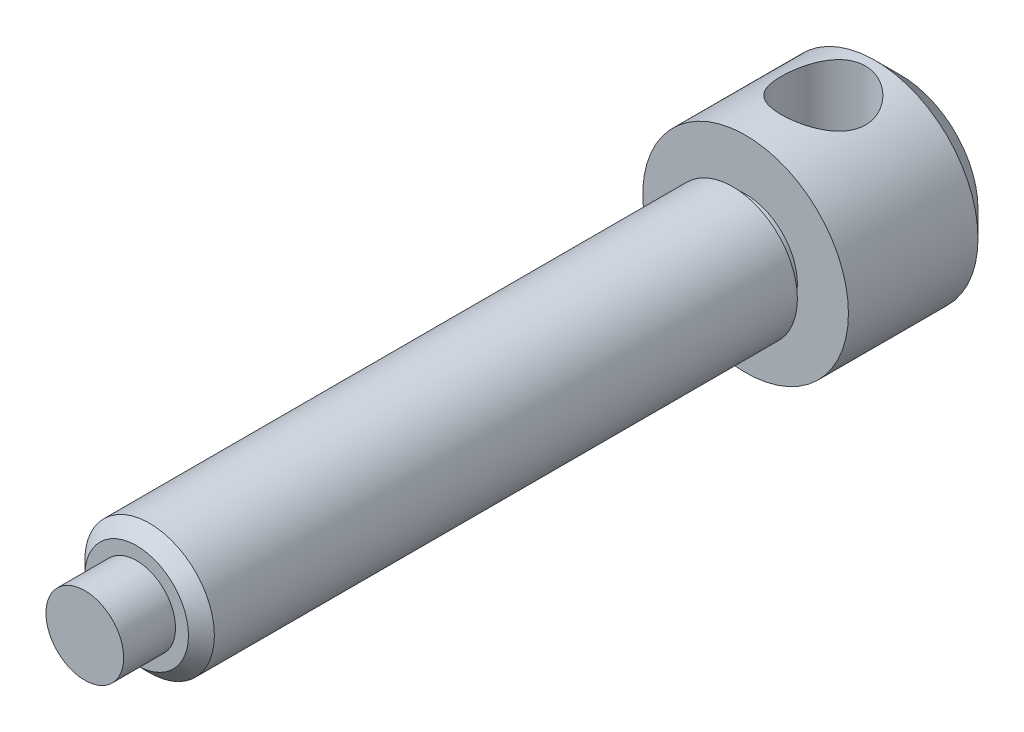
ISO-10303-21;
HEADER;
FILE_DESCRIPTION(('STEP AP214'),'2;1');
FILE_NAME('part.step','',(''),(''),'','','');
FILE_SCHEMA(('AUTOMOTIVE_DESIGN { 1 0 10303 214 1 1 1 1 }'));
ENDSEC;
DATA;
#1=APPLICATION_CONTEXT('core data for automotive mechanical design processes');
#2=APPLICATION_PROTOCOL_DEFINITION('international standard','automotive_design',2000,#1);
#3=PRODUCT_CONTEXT('',#1,'mechanical');
#4=PRODUCT('Part','Part','',(#3));
#5=PRODUCT_RELATED_PRODUCT_CATEGORY('part','',(#4));
#6=PRODUCT_DEFINITION_FORMATION('','',#4);
#7=PRODUCT_DEFINITION_CONTEXT('part definition',#1,'design');
#8=PRODUCT_DEFINITION('design','',#6,#7);
#9=PRODUCT_DEFINITION_SHAPE('','',#8);
#10=(LENGTH_UNIT() NAMED_UNIT(*) SI_UNIT(.MILLI.,.METRE.));
#11=(NAMED_UNIT(*) PLANE_ANGLE_UNIT() SI_UNIT($,.RADIAN.));
#12=(NAMED_UNIT(*) SI_UNIT($,.STERADIAN.) SOLID_ANGLE_UNIT());
#13=UNCERTAINTY_MEASURE_WITH_UNIT(LENGTH_MEASURE(1.E-05),#10,'distance_accuracy_value','');
#14=(GEOMETRIC_REPRESENTATION_CONTEXT(3) GLOBAL_UNCERTAINTY_ASSIGNED_CONTEXT((#13)) GLOBAL_UNIT_ASSIGNED_CONTEXT((#10,
#11,#12)) REPRESENTATION_CONTEXT('',''));
#15=CARTESIAN_POINT('',(0.,0.,0.));
#16=DIRECTION('',(0.,0.,1.));
#17=DIRECTION('',(1.,0.,0.));
#18=AXIS2_PLACEMENT_3D('',#15,#16,#17);
#19=CARTESIAN_POINT('',(0.,0.,12.));
#20=DIRECTION('',(0.,0.,-1.));
#21=DIRECTION('',(-1.,0.,0.));
#22=AXIS2_PLACEMENT_3D('',#19,#20,#21);
#23=CYLINDRICAL_SURFACE('',#22,7.9375);
#24=CARTESIAN_POINT('',(0.,0.,2.));
#25=DIRECTION('',(0.,0.,1.));
#26=DIRECTION('',(1.,0.,0.));
#27=AXIS2_PLACEMENT_3D('',#24,#25,#26);
#28=CIRCLE('',#27,7.9375);
#29=CARTESIAN_POINT('',(7.9375,0.,2.));
#30=VERTEX_POINT('',#29);
#31=EDGE_CURVE('E64',#30,#30,#28,.T.);
#32=ORIENTED_EDGE('',*,*,#31,.T.);
#33=EDGE_LOOP('',(#32));
#34=FACE_BOUND('',#33,.T.);
#35=CARTESIAN_POINT('',(0.,-7.9375,9.25));
#36=CARTESIAN_POINT('',(0.0872114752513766,-7.93749935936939,9.24999911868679));
#37=CARTESIAN_POINT('',(0.174458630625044,-7.93605721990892,9.24648240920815));
#38=CARTESIAN_POINT('',(0.348311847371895,-7.93033291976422,9.23246125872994));
#39=CARTESIAN_POINT('',(0.434917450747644,-7.92604889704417,9.2219522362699));
#40=CARTESIAN_POINT('',(0.693150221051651,-7.90905186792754,9.18000207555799));
#41=CARTESIAN_POINT('',(0.862947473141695,-7.89219432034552,9.13813816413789));
#42=CARTESIAN_POINT('',(1.19191578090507,-7.84925293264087,9.02850896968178));
#43=CARTESIAN_POINT('',(1.35112025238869,-7.82319991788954,8.96083016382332));
#44=CARTESIAN_POINT('',(1.65580455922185,-7.76442428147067,8.80184310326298));
#45=CARTESIAN_POINT('',(1.80128879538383,-7.73170380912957,8.71054246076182));
#46=CARTESIAN_POINT('',(2.08168417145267,-7.6610928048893,8.50219001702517));
#47=CARTESIAN_POINT('',(2.21583434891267,-7.62303677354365,8.38417131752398));
#48=CARTESIAN_POINT('',(2.46309024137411,-7.54677831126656,8.12777556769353));
#49=CARTESIAN_POINT('',(2.57618522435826,-7.50857581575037,7.98938819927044));
#50=CARTESIAN_POINT('',(2.78337576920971,-7.43434086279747,7.6882707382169));
#51=CARTESIAN_POINT('',(2.87632468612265,-7.39849553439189,7.5247007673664));
#52=CARTESIAN_POINT('',(3.03305054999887,-7.33564540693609,7.18256433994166));
#53=CARTESIAN_POINT('',(3.09684201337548,-7.30863621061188,7.00400539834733));
#54=CARTESIAN_POINT('',(3.19032953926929,-7.26830112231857,6.64570792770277));
#55=CARTESIAN_POINT('',(3.22148606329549,-7.25439221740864,6.46641856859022));
#56=CARTESIAN_POINT('',(3.25337848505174,-7.24014999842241,6.10465858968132));
#57=CARTESIAN_POINT('',(3.25413034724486,-7.23980956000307,5.92218968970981));
#58=CARTESIAN_POINT('',(3.22629503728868,-7.25224759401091,5.57356884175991));
#59=CARTESIAN_POINT('',(3.19986145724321,-7.26406311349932,5.40720378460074));
#60=CARTESIAN_POINT('',(3.12200857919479,-7.29785929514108,5.08151885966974));
#61=CARTESIAN_POINT('',(3.07058468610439,-7.31984182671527,4.92220029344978));
#62=CARTESIAN_POINT('',(2.94321760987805,-7.37198609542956,4.61118367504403));
#63=CARTESIAN_POINT('',(2.86678407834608,-7.40230929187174,4.45971471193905));
#64=CARTESIAN_POINT('',(2.69191295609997,-7.46767767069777,4.17117749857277));
#65=CARTESIAN_POINT('',(2.59346686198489,-7.502724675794,4.03411484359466));
#66=CARTESIAN_POINT('',(2.36795931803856,-7.57706169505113,3.76654761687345));
#67=CARTESIAN_POINT('',(2.23922161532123,-7.61646495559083,3.63748335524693));
#68=CARTESIAN_POINT('',(1.96152550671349,-7.69266136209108,3.40230257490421));
#69=CARTESIAN_POINT('',(1.81256269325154,-7.72945393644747,3.29619107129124));
#70=CARTESIAN_POINT('',(1.49439584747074,-7.79728624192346,3.10791402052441));
#71=CARTESIAN_POINT('',(1.32482419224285,-7.82818459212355,3.02631503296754));
#72=CARTESIAN_POINT('',(0.972773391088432,-7.87966918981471,2.89330295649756));
#73=CARTESIAN_POINT('',(0.790301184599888,-7.90026093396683,2.84187377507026));
#74=CARTESIAN_POINT('',(0.429681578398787,-7.9277963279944,2.77363121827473));
#75=CARTESIAN_POINT('',(0.251958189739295,-7.93550134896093,2.75488375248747));
#76=CARTESIAN_POINT('',(-0.104246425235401,-7.93881143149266,2.7467948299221));
#77=CARTESIAN_POINT('',(-0.282727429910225,-7.93441981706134,2.75744529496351));
#78=CARTESIAN_POINT('',(-0.626451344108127,-7.91452603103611,2.80644851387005));
#79=CARTESIAN_POINT('',(-0.791920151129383,-7.89956218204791,2.84345972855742));
#80=CARTESIAN_POINT('',(-1.11413118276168,-7.860596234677,2.94228502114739));
#81=CARTESIAN_POINT('',(-1.27087229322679,-7.83659298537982,3.00410225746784));
#82=CARTESIAN_POINT('',(-1.57663618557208,-7.78094023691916,3.1528058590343));
#83=CARTESIAN_POINT('',(-1.72527095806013,-7.74907743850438,3.24040765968));
#84=CARTESIAN_POINT('',(-2.00625906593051,-7.68113023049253,3.4374044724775));
#85=CARTESIAN_POINT('',(-2.13860567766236,-7.64504408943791,3.54680843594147));
#86=CARTESIAN_POINT('',(-2.39286503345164,-7.56947127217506,3.79315808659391));
#87=CARTESIAN_POINT('',(-2.51342484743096,-7.5299219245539,3.9314845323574));
#88=CARTESIAN_POINT('',(-2.72997831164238,-7.45414789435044,4.22706739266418));
#89=CARTESIAN_POINT('',(-2.82596707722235,-7.41792387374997,4.38432756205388));
#90=CARTESIAN_POINT('',(-2.99149511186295,-7.35274844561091,4.71616590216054));
#91=CARTESIAN_POINT('',(-3.06069792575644,-7.32389100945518,4.89093170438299));
#92=CARTESIAN_POINT('',(-3.16812703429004,-7.2780733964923,5.25118247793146));
#93=CARTESIAN_POINT('',(-3.20637769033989,-7.26110386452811,5.43665889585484));
#94=CARTESIAN_POINT('',(-3.24843599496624,-7.24237881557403,5.79811049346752));
#95=CARTESIAN_POINT('',(-3.25460676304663,-7.23957988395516,5.9737581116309));
#96=CARTESIAN_POINT('',(-3.23859385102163,-7.24675749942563,6.32347208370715));
#97=CARTESIAN_POINT('',(-3.21641417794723,-7.25673224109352,6.49753865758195));
#98=CARTESIAN_POINT('',(-3.14629169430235,-7.28739392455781,6.83138137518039));
#99=CARTESIAN_POINT('',(-3.09950922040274,-7.30759698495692,6.9914498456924));
#100=CARTESIAN_POINT('',(-2.98262133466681,-7.35607625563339,7.30151502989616));
#101=CARTESIAN_POINT('',(-2.91250941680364,-7.38435471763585,7.45150891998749));
#102=CARTESIAN_POINT('',(-2.74619029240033,-7.44786581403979,7.74680507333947));
#103=CARTESIAN_POINT('',(-2.64868889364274,-7.48341002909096,7.89131012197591));
#104=CARTESIAN_POINT('',(-2.43219717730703,-7.55654415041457,8.16265050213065));
#105=CARTESIAN_POINT('',(-2.31319982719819,-7.59413472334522,8.28948002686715));
#106=CARTESIAN_POINT('',(-2.04732477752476,-7.67025307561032,8.53089036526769));
#107=CARTESIAN_POINT('',(-1.89908649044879,-7.70866528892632,8.64401334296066));
#108=CARTESIAN_POINT('',(-1.58418806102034,-7.77947285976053,8.84386405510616));
#109=CARTESIAN_POINT('',(-1.41751951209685,-7.81186545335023,8.93057967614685));
#110=CARTESIAN_POINT('',(-1.15884715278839,-7.85292920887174,9.03778365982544));
#111=CARTESIAN_POINT('',(-1.07193923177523,-7.86529009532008,9.06953395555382));
#112=CARTESIAN_POINT('',(-0.895435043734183,-7.88733074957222,9.12558012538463));
#113=CARTESIAN_POINT('',(-0.805840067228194,-7.89701178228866,9.14987951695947));
#114=CARTESIAN_POINT('',(-0.624876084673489,-7.91338594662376,9.19070809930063));
#115=CARTESIAN_POINT('',(-0.53351209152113,-7.92008651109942,9.20725662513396));
#116=CARTESIAN_POINT('',(-0.349572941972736,-7.93033259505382,9.23247635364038));
#117=CARTESIAN_POINT('',(-0.256998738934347,-7.93388046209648,9.24115341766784));
#118=CARTESIAN_POINT('',(-0.136881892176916,-7.9363669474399,9.24723181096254));
#119=CARTESIAN_POINT('',(-0.109518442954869,-7.93679161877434,9.24826959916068));
#120=CARTESIAN_POINT('',(-0.0547711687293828,-7.93735824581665,9.24965383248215));
#121=CARTESIAN_POINT('',(-0.027387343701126,-7.93750020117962,9.25000027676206));
#122=CARTESIAN_POINT('',(0.,-7.9375,9.25));
#123=B_SPLINE_CURVE_WITH_KNOTS('',3,(#35,#36,#37,#38,#39,#40,#41,#42,#43,#44,#45,#46,#47,#48,
#49,#50,#51,#52,#53,#54,#55,#56,#57,#58,#59,#60,#61,#62,#63,#64,#65,#66,#67,#68,#69,#70,#71,#72,
#73,#74,#75,#76,#77,#78,#79,#80,#81,#82,#83,#84,#85,#86,#87,#88,#89,#90,#91,#92,#93,#94,#95,#96,
#97,#98,#99,#100,#101,#102,#103,#104,#105,#106,#107,#108,#109,#110,#111,#112,#113,#114,#115,
#116,#117,#118,#119,#120,#121,#122),.UNSPECIFIED.,.T.,.F.,(4,2,2,2,2,2,2,2,2,2,2,2,2,2,2,2,2,2,
2,2,2,2,2,2,2,2,2,2,2,2,2,2,2,2,2,2,2,2,2,2,2,2,2,4),(0.,0.2616040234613,0.523379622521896,
1.04765867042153,1.57019664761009,2.09256644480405,2.63823417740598,3.18417928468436,
3.75585462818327,4.32724504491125,4.87180262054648,5.41607426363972,5.92031894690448,
6.42465638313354,6.93954253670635,7.45462793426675,8.01161113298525,8.56871590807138,
9.13785062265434,9.70668148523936,10.2405345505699,10.7742409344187,11.2825655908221,
11.7909549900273,12.3150493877,12.8393594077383,13.3998996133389,13.960551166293,
14.5280326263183,15.0950670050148,15.6196714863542,16.1442018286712,16.6459592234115,
17.1478566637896,17.67932747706,18.2109724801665,18.7794587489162,19.348205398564,
19.6279421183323,19.9075465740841,20.1864497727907,20.4651451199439,20.5472975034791,
20.6294499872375),.UNSPECIFIED.);
#124=CARTESIAN_POINT('',(0.,-7.9375,9.25));
#125=VERTEX_POINT('',#124);
#126=EDGE_CURVE('E70',#125,#125,#123,.T.);
#127=ORIENTED_EDGE('',*,*,#126,.T.);
#128=EDGE_LOOP('',(#127));
#129=FACE_BOUND('',#128,.T.);
#130=CARTESIAN_POINT('',(0.,7.9375,9.25));
#131=CARTESIAN_POINT('',(-0.0872114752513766,7.93749935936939,9.24999911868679));
#132=CARTESIAN_POINT('',(-0.174458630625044,7.93605721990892,9.24648240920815));
#133=CARTESIAN_POINT('',(-0.348311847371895,7.93033291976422,9.23246125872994));
#134=CARTESIAN_POINT('',(-0.434917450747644,7.92604889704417,9.2219522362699));
#135=CARTESIAN_POINT('',(-0.693150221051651,7.90905186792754,9.18000207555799));
#136=CARTESIAN_POINT('',(-0.862947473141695,7.89219432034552,9.13813816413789));
#137=CARTESIAN_POINT('',(-1.19191578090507,7.84925293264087,9.02850896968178));
#138=CARTESIAN_POINT('',(-1.35112025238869,7.82319991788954,8.96083016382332));
#139=CARTESIAN_POINT('',(-1.65580455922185,7.76442428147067,8.80184310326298));
#140=CARTESIAN_POINT('',(-1.80128879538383,7.73170380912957,8.71054246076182));
#141=CARTESIAN_POINT('',(-2.08168417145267,7.6610928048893,8.50219001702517));
#142=CARTESIAN_POINT('',(-2.21583434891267,7.62303677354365,8.38417131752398));
#143=CARTESIAN_POINT('',(-2.46309024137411,7.54677831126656,8.12777556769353));
#144=CARTESIAN_POINT('',(-2.57618522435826,7.50857581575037,7.98938819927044));
#145=CARTESIAN_POINT('',(-2.78337576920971,7.43434086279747,7.6882707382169));
#146=CARTESIAN_POINT('',(-2.87632468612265,7.39849553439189,7.5247007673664));
#147=CARTESIAN_POINT('',(-3.03305054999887,7.33564540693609,7.18256433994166));
#148=CARTESIAN_POINT('',(-3.09684201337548,7.30863621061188,7.00400539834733));
#149=CARTESIAN_POINT('',(-3.19032953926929,7.26830112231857,6.64570792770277));
#150=CARTESIAN_POINT('',(-3.22148606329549,7.25439221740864,6.46641856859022));
#151=CARTESIAN_POINT('',(-3.25337848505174,7.24014999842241,6.10465858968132));
#152=CARTESIAN_POINT('',(-3.25413034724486,7.23980956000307,5.92218968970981));
#153=CARTESIAN_POINT('',(-3.22629503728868,7.25224759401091,5.57356884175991));
#154=CARTESIAN_POINT('',(-3.19986145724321,7.26406311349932,5.40720378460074));
#155=CARTESIAN_POINT('',(-3.12200857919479,7.29785929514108,5.08151885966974));
#156=CARTESIAN_POINT('',(-3.07058468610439,7.31984182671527,4.92220029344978));
#157=CARTESIAN_POINT('',(-2.94321760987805,7.37198609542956,4.61118367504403));
#158=CARTESIAN_POINT('',(-2.86678407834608,7.40230929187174,4.45971471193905));
#159=CARTESIAN_POINT('',(-2.69191295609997,7.46767767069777,4.17117749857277));
#160=CARTESIAN_POINT('',(-2.59346686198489,7.502724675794,4.03411484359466));
#161=CARTESIAN_POINT('',(-2.36795931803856,7.57706169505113,3.76654761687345));
#162=CARTESIAN_POINT('',(-2.23922161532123,7.61646495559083,3.63748335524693));
#163=CARTESIAN_POINT('',(-1.96152550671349,7.69266136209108,3.40230257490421));
#164=CARTESIAN_POINT('',(-1.81256269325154,7.72945393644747,3.29619107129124));
#165=CARTESIAN_POINT('',(-1.49439584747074,7.79728624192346,3.10791402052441));
#166=CARTESIAN_POINT('',(-1.32482419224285,7.82818459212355,3.02631503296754));
#167=CARTESIAN_POINT('',(-0.972773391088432,7.87966918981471,2.89330295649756));
#168=CARTESIAN_POINT('',(-0.790301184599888,7.90026093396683,2.84187377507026));
#169=CARTESIAN_POINT('',(-0.429681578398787,7.9277963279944,2.77363121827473));
#170=CARTESIAN_POINT('',(-0.251958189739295,7.93550134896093,2.75488375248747));
#171=CARTESIAN_POINT('',(0.104246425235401,7.93881143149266,2.7467948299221));
#172=CARTESIAN_POINT('',(0.282727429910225,7.93441981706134,2.75744529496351));
#173=CARTESIAN_POINT('',(0.626451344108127,7.91452603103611,2.80644851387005));
#174=CARTESIAN_POINT('',(0.791920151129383,7.89956218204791,2.84345972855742));
#175=CARTESIAN_POINT('',(1.11413118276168,7.860596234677,2.94228502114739));
#176=CARTESIAN_POINT('',(1.27087229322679,7.83659298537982,3.00410225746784));
#177=CARTESIAN_POINT('',(1.57663618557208,7.78094023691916,3.1528058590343));
#178=CARTESIAN_POINT('',(1.72527095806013,7.74907743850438,3.24040765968));
#179=CARTESIAN_POINT('',(2.00625906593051,7.68113023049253,3.4374044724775));
#180=CARTESIAN_POINT('',(2.13860567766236,7.64504408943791,3.54680843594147));
#181=CARTESIAN_POINT('',(2.39286503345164,7.56947127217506,3.79315808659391));
#182=CARTESIAN_POINT('',(2.51342484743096,7.5299219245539,3.9314845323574));
#183=CARTESIAN_POINT('',(2.72997831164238,7.45414789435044,4.22706739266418));
#184=CARTESIAN_POINT('',(2.82596707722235,7.41792387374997,4.38432756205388));
#185=CARTESIAN_POINT('',(2.99149511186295,7.35274844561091,4.71616590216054));
#186=CARTESIAN_POINT('',(3.06069792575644,7.32389100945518,4.89093170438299));
#187=CARTESIAN_POINT('',(3.16812703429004,7.2780733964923,5.25118247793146));
#188=CARTESIAN_POINT('',(3.20637769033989,7.26110386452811,5.43665889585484));
#189=CARTESIAN_POINT('',(3.24843599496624,7.24237881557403,5.79811049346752));
#190=CARTESIAN_POINT('',(3.25460676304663,7.23957988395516,5.9737581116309));
#191=CARTESIAN_POINT('',(3.23859385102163,7.24675749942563,6.32347208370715));
#192=CARTESIAN_POINT('',(3.21641417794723,7.25673224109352,6.49753865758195));
#193=CARTESIAN_POINT('',(3.14629169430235,7.28739392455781,6.83138137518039));
#194=CARTESIAN_POINT('',(3.09950922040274,7.30759698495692,6.9914498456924));
#195=CARTESIAN_POINT('',(2.98262133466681,7.35607625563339,7.30151502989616));
#196=CARTESIAN_POINT('',(2.91250941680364,7.38435471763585,7.45150891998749));
#197=CARTESIAN_POINT('',(2.74619029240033,7.44786581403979,7.74680507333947));
#198=CARTESIAN_POINT('',(2.64868889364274,7.48341002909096,7.89131012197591));
#199=CARTESIAN_POINT('',(2.43219717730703,7.55654415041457,8.16265050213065));
#200=CARTESIAN_POINT('',(2.31319982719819,7.59413472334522,8.28948002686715));
#201=CARTESIAN_POINT('',(2.04732477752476,7.67025307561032,8.53089036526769));
#202=CARTESIAN_POINT('',(1.89908649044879,7.70866528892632,8.64401334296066));
#203=CARTESIAN_POINT('',(1.58418806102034,7.77947285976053,8.84386405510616));
#204=CARTESIAN_POINT('',(1.41751951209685,7.81186545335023,8.93057967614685));
#205=CARTESIAN_POINT('',(1.15884715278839,7.85292920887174,9.03778365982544));
#206=CARTESIAN_POINT('',(1.07193923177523,7.86529009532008,9.06953395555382));
#207=CARTESIAN_POINT('',(0.895435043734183,7.88733074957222,9.12558012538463));
#208=CARTESIAN_POINT('',(0.805840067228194,7.89701178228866,9.14987951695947));
#209=CARTESIAN_POINT('',(0.624876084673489,7.91338594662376,9.19070809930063));
#210=CARTESIAN_POINT('',(0.53351209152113,7.92008651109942,9.20725662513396));
#211=CARTESIAN_POINT('',(0.349572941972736,7.93033259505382,9.23247635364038));
#212=CARTESIAN_POINT('',(0.256998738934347,7.93388046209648,9.24115341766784));
#213=CARTESIAN_POINT('',(0.136881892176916,7.9363669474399,9.24723181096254));
#214=CARTESIAN_POINT('',(0.109518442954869,7.93679161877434,9.24826959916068));
#215=CARTESIAN_POINT('',(0.0547711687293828,7.93735824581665,9.24965383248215));
#216=CARTESIAN_POINT('',(0.027387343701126,7.93750020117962,9.25000027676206));
#217=CARTESIAN_POINT('',(0.,7.9375,9.25));
#218=B_SPLINE_CURVE_WITH_KNOTS('',3,(#130,#131,#132,#133,#134,#135,#136,#137,#138,#139,#140,
#141,#142,#143,#144,#145,#146,#147,#148,#149,#150,#151,#152,#153,#154,#155,#156,#157,#158,#159,
#160,#161,#162,#163,#164,#165,#166,#167,#168,#169,#170,#171,#172,#173,#174,#175,#176,#177,#178,
#179,#180,#181,#182,#183,#184,#185,#186,#187,#188,#189,#190,#191,#192,#193,#194,#195,#196,#197,
#198,#199,#200,#201,#202,#203,#204,#205,#206,#207,#208,#209,#210,#211,#212,#213,#214,#215,#216,
#217),.UNSPECIFIED.,.T.,.F.,(4,2,2,2,2,2,2,2,2,2,2,2,2,2,2,2,2,2,2,2,2,2,2,2,2,2,2,2,2,2,2,2,2,
2,2,2,2,2,2,2,2,2,2,4),(0.,0.2616040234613,0.523379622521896,1.04765867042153,1.57019664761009,
2.09256644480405,2.63823417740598,3.18417928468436,3.75585462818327,4.32724504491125,
4.87180262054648,5.41607426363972,5.92031894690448,6.42465638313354,6.93954253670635,
7.45462793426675,8.01161113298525,8.56871590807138,9.13785062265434,9.70668148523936,
10.2405345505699,10.7742409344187,11.2825655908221,11.7909549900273,12.3150493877,
12.8393594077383,13.3998996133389,13.960551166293,14.5280326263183,15.0950670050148,
15.6196714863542,16.1442018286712,16.6459592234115,17.1478566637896,17.67932747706,
18.2109724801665,18.7794587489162,19.348205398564,19.6279421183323,19.9075465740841,
20.1864497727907,20.4651451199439,20.5472975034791,20.6294499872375),.UNSPECIFIED.);
#219=CARTESIAN_POINT('',(0.,7.9375,9.25));
#220=VERTEX_POINT('',#219);
#221=EDGE_CURVE('E79',#220,#220,#218,.T.);
#222=ORIENTED_EDGE('',*,*,#221,.T.);
#223=EDGE_LOOP('',(#222));
#224=FACE_BOUND('',#223,.T.);
#225=CARTESIAN_POINT('',(0.,0.,12.));
#226=DIRECTION('',(0.,0.,1.));
#227=DIRECTION('',(1.,0.,0.));
#228=AXIS2_PLACEMENT_3D('',#225,#226,#227);
#229=CIRCLE('',#228,7.9375);
#230=CARTESIAN_POINT('',(7.9375,0.,12.));
#231=VERTEX_POINT('',#230);
#232=EDGE_CURVE('E136',#231,#231,#229,.T.);
#233=ORIENTED_EDGE('',*,*,#232,.F.);
#234=EDGE_LOOP('',(#233));
#235=FACE_BOUND('',#234,.T.);
#236=ADVANCED_FACE('F45',(#34,#129,#224,#235),#23,.T.);
#237=CARTESIAN_POINT('',(0.,0.,12.));
#238=DIRECTION('',(0.,0.,1.));
#239=DIRECTION('',(1.,0.,0.));
#240=AXIS2_PLACEMENT_3D('',#237,#238,#239);
#241=PLANE('',#240);
#242=CARTESIAN_POINT('',(0.,0.,12.));
#243=DIRECTION('',(0.,0.,1.));
#244=DIRECTION('',(1.,0.,0.));
#245=AXIS2_PLACEMENT_3D('',#242,#243,#244);
#246=CIRCLE('',#245,4.);
#247=CARTESIAN_POINT('',(4.,0.,12.));
#248=VERTEX_POINT('',#247);
#249=EDGE_CURVE('E139',#248,#248,#246,.T.);
#250=ORIENTED_EDGE('',*,*,#249,.F.);
#251=EDGE_LOOP('',(#250));
#252=FACE_BOUND('',#251,.T.);
#253=ORIENTED_EDGE('',*,*,#232,.T.);
#254=EDGE_LOOP('',(#253));
#255=FACE_BOUND('',#254,.T.);
#256=ADVANCED_FACE('F116',(#252,#255),#241,.T.);
#257=CARTESIAN_POINT('',(0.,0.,0.));
#258=DIRECTION('',(0.,0.,1.));
#259=DIRECTION('',(1.,0.,0.));
#260=AXIS2_PLACEMENT_3D('',#257,#258,#259);
#261=PLANE('',#260);
#262=CARTESIAN_POINT('',(0.,0.,0.));
#263=DIRECTION('',(0.,0.,1.));
#264=DIRECTION('',(1.,0.,0.));
#265=AXIS2_PLACEMENT_3D('',#262,#263,#264);
#266=CIRCLE('',#265,5.9375);
#267=CARTESIAN_POINT('',(5.9375,0.,0.));
#268=VERTEX_POINT('',#267);
#269=EDGE_CURVE('E59',#268,#268,#266,.F.);
#270=ORIENTED_EDGE('',*,*,#269,.T.);
#271=EDGE_LOOP('',(#270));
#272=FACE_BOUND('',#271,.T.);
#273=ADVANCED_FACE('F114',(#272),#261,.F.);
#274=CARTESIAN_POINT('',(0.,0.,13.));
#275=DIRECTION('',(0.,0.,-1.));
#276=DIRECTION('',(-1.,0.,0.));
#277=AXIS2_PLACEMENT_3D('',#274,#275,#276);
#278=CYLINDRICAL_SURFACE('',#277,4.);
#279=CARTESIAN_POINT('',(0.,0.,13.));
#280=DIRECTION('',(0.,0.,1.));
#281=DIRECTION('',(1.,0.,0.));
#282=AXIS2_PLACEMENT_3D('',#279,#280,#281);
#283=CIRCLE('',#282,4.);
#284=CARTESIAN_POINT('',(4.,0.,13.));
#285=VERTEX_POINT('',#284);
#286=EDGE_CURVE('E140',#285,#285,#283,.T.);
#287=ORIENTED_EDGE('',*,*,#286,.F.);
#288=EDGE_LOOP('',(#287));
#289=FACE_BOUND('',#288,.T.);
#290=ORIENTED_EDGE('',*,*,#249,.T.);
#291=EDGE_LOOP('',(#290));
#292=FACE_BOUND('',#291,.T.);
#293=ADVANCED_FACE('F111',(#289,#292),#278,.T.);
#294=CARTESIAN_POINT('',(0.,0.,59.));
#295=DIRECTION('',(0.,0.,-1.));
#296=DIRECTION('',(-1.,0.,0.));
#297=AXIS2_PLACEMENT_3D('',#294,#295,#296);
#298=CYLINDRICAL_SURFACE('',#297,5.);
#299=CARTESIAN_POINT('',(0.,0.,58.));
#300=DIRECTION('',(0.,0.,1.));
#301=DIRECTION('',(1.,0.,0.));
#302=AXIS2_PLACEMENT_3D('',#299,#300,#301);
#303=CIRCLE('',#302,5.);
#304=CARTESIAN_POINT('',(5.,0.,58.));
#305=VERTEX_POINT('',#304);
#306=EDGE_CURVE('E10',#305,#305,#303,.F.);
#307=ORIENTED_EDGE('',*,*,#306,.T.);
#308=EDGE_LOOP('',(#307));
#309=FACE_BOUND('',#308,.T.);
#310=CARTESIAN_POINT('',(0.,0.,13.));
#311=DIRECTION('',(0.,0.,1.));
#312=DIRECTION('',(1.,0.,0.));
#313=AXIS2_PLACEMENT_3D('',#310,#311,#312);
#314=CIRCLE('',#313,5.);
#315=CARTESIAN_POINT('',(5.,0.,13.));
#316=VERTEX_POINT('',#315);
#317=EDGE_CURVE('E147',#316,#316,#314,.T.);
#318=ORIENTED_EDGE('',*,*,#317,.T.);
#319=EDGE_LOOP('',(#318));
#320=FACE_BOUND('',#319,.T.);
#321=ADVANCED_FACE('F105',(#309,#320),#298,.T.);
#322=CARTESIAN_POINT('',(0.,0.,59.));
#323=DIRECTION('',(0.,0.,1.));
#324=DIRECTION('',(1.,0.,0.));
#325=AXIS2_PLACEMENT_3D('',#322,#323,#324);
#326=PLANE('',#325);
#327=CARTESIAN_POINT('',(0.,0.,59.));
#328=DIRECTION('',(0.,0.,1.));
#329=DIRECTION('',(1.,0.,0.));
#330=AXIS2_PLACEMENT_3D('',#327,#328,#329);
#331=CIRCLE('',#330,3.99999999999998);
#332=CARTESIAN_POINT('',(3.99999999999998,0.,59.));
#333=VERTEX_POINT('',#332);
#334=EDGE_CURVE('E54',#333,#333,#331,.T.);
#335=ORIENTED_EDGE('',*,*,#334,.T.);
#336=EDGE_LOOP('',(#335));
#337=FACE_BOUND('',#336,.T.);
#338=CARTESIAN_POINT('',(0.,0.,59.));
#339=DIRECTION('',(0.,0.,1.));
#340=DIRECTION('',(1.,0.,0.));
#341=AXIS2_PLACEMENT_3D('',#338,#339,#340);
#342=CIRCLE('',#341,3.);
#343=CARTESIAN_POINT('',(3.,0.,59.));
#344=VERTEX_POINT('',#343);
#345=EDGE_CURVE('E144',#344,#344,#342,.T.);
#346=ORIENTED_EDGE('',*,*,#345,.F.);
#347=EDGE_LOOP('',(#346));
#348=FACE_BOUND('',#347,.T.);
#349=ADVANCED_FACE('F102',(#337,#348),#326,.T.);
#350=CARTESIAN_POINT('',(0.,0.,13.));
#351=DIRECTION('',(0.,0.,1.));
#352=DIRECTION('',(1.,0.,0.));
#353=AXIS2_PLACEMENT_3D('',#350,#351,#352);
#354=PLANE('',#353);
#355=ORIENTED_EDGE('',*,*,#286,.T.);
#356=EDGE_LOOP('',(#355));
#357=FACE_BOUND('',#356,.T.);
#358=ORIENTED_EDGE('',*,*,#317,.F.);
#359=EDGE_LOOP('',(#358));
#360=FACE_BOUND('',#359,.T.);
#361=ADVANCED_FACE('F100',(#357,#360),#354,.F.);
#362=CARTESIAN_POINT('',(0.,0.,63.));
#363=DIRECTION('',(0.,0.,-1.));
#364=DIRECTION('',(-1.,0.,0.));
#365=AXIS2_PLACEMENT_3D('',#362,#363,#364);
#366=CYLINDRICAL_SURFACE('',#365,3.);
#367=CARTESIAN_POINT('',(0.,0.,63.));
#368=DIRECTION('',(0.,0.,1.));
#369=DIRECTION('',(1.,0.,0.));
#370=AXIS2_PLACEMENT_3D('',#367,#368,#369);
#371=CIRCLE('',#370,3.);
#372=CARTESIAN_POINT('',(3.,0.,63.));
#373=VERTEX_POINT('',#372);
#374=EDGE_CURVE('E153',#373,#373,#371,.T.);
#375=ORIENTED_EDGE('',*,*,#374,.F.);
#376=EDGE_LOOP('',(#375));
#377=FACE_BOUND('',#376,.T.);
#378=ORIENTED_EDGE('',*,*,#345,.T.);
#379=EDGE_LOOP('',(#378));
#380=FACE_BOUND('',#379,.T.);
#381=ADVANCED_FACE('F96',(#377,#380),#366,.T.);
#382=CARTESIAN_POINT('',(0.,0.,63.));
#383=DIRECTION('',(0.,0.,1.));
#384=DIRECTION('',(1.,0.,0.));
#385=AXIS2_PLACEMENT_3D('',#382,#383,#384);
#386=PLANE('',#385);
#387=ORIENTED_EDGE('',*,*,#374,.T.);
#388=EDGE_LOOP('',(#387));
#389=FACE_BOUND('',#388,.T.);
#390=ADVANCED_FACE('F91',(#389),#386,.T.);
#391=CARTESIAN_POINT('',(0.,-7.9375,6.));
#392=DIRECTION('',(0.,1.,0.));
#393=DIRECTION('',(0.,0.,1.));
#394=AXIS2_PLACEMENT_3D('',#391,#392,#393);
#395=CYLINDRICAL_SURFACE('',#394,3.25);
#396=ORIENTED_EDGE('',*,*,#221,.F.);
#397=EDGE_LOOP('',(#396));
#398=FACE_BOUND('',#397,.T.);
#399=ORIENTED_EDGE('',*,*,#126,.F.);
#400=EDGE_LOOP('',(#399));
#401=FACE_BOUND('',#400,.T.);
#402=ADVANCED_FACE('F86',(#398,#401),#395,.F.);
#403=CARTESIAN_POINT('',(0.,0.,2.));
#404=DIRECTION('',(0.,0.,1.));
#405=DIRECTION('',(1.,0.,0.));
#406=AXIS2_PLACEMENT_3D('',#403,#404,#405);
#407=CONICAL_SURFACE('',#406,7.9375,0.78539816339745);
#408=ORIENTED_EDGE('',*,*,#269,.F.);
#409=EDGE_LOOP('',(#408));
#410=FACE_BOUND('',#409,.T.);
#411=ORIENTED_EDGE('',*,*,#31,.F.);
#412=EDGE_LOOP('',(#411));
#413=FACE_BOUND('',#412,.T.);
#414=ADVANCED_FACE('F90',(#410,#413),#407,.T.);
#415=CARTESIAN_POINT('',(0.,0.,59.));
#416=DIRECTION('',(0.,0.,-1.));
#417=DIRECTION('',(-1.,0.,0.));
#418=AXIS2_PLACEMENT_3D('',#415,#416,#417);
#419=CONICAL_SURFACE('',#418,3.99999999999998,0.785398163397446);
#420=ORIENTED_EDGE('',*,*,#306,.F.);
#421=EDGE_LOOP('',(#420));
#422=FACE_BOUND('',#421,.T.);
#423=ORIENTED_EDGE('',*,*,#334,.F.);
#424=EDGE_LOOP('',(#423));
#425=FACE_BOUND('',#424,.T.);
#426=ADVANCED_FACE('F48',(#422,#425),#419,.T.);
#427=CLOSED_SHELL('',(#236,#256,#273,#293,#321,#349,#361,#381,#390,#402,#414,#426));
#428=MANIFOLD_SOLID_BREP('B2',#427);
#429=ADVANCED_BREP_SHAPE_REPRESENTATION('',(#18,#428),#14);
#430=SHAPE_DEFINITION_REPRESENTATION(#9,#429);
ENDSEC;
END-ISO-10303-21;
